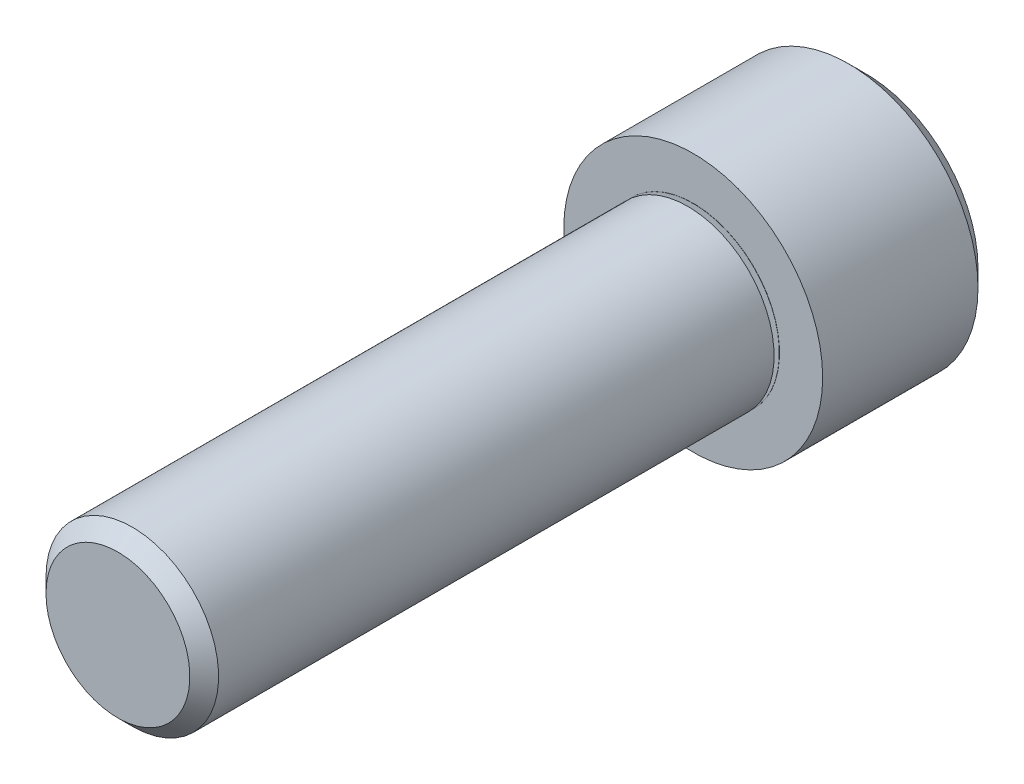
from build123d import *

# Parameters (mm, degrees)
CUT_EXTRUDE1_DEPTH = 4.7625


with BuildPart() as part:
    # Logo3_bib1 → Revolve1 (revolve)
    with BuildSketch(Plane(origin=(0, 0, 0), x_dir=(-1, 0, 0), z_dir=(0, -1, 0))):
        with BuildLine():
            Line((0, -31.75), (0, 9.525))
            Line((0, 9.525), (6.19125, 9.525))
            Line((6.19125, 9.525), (7.14375, 8.5725))
            Line((7.14375, 8.5725), (7.14375, 0))
            Line((7.14375, 0), (4.7625, 0))
            Line((4.7625, 0), (4.7625, -0.01))
            Line((4.7625, -0.01), (4.082175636, -0.01))
            ThreePointArc((4.082175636, -0.01), (4.062479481, -0.026527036), (4.075335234, -0.048793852))
            Line((4.075335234, -0.048793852), (4.7625, -0.298901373))
            Line((4.7625, -0.298901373), (4.7625, -30.95625))
            Line((4.7625, -30.95625), (3.96875, -31.75))
            Line((3.96875, -31.75), (0, -31.75))
        make_face()
    revolve(axis=Axis((0, 0, -10.585154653), (0, 0, 1)))

    # Logo3_bib2 → Cut-Extrude1 (cut)
    with BuildSketch(Plane(origin=(0, 0, -9.525), x_dir=(1, 0, 0), z_dir=(0, 0, -1))):
        Polygon((4.575385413, 0), (2.287692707, 3.9624), (-2.287692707, 3.9624), (-4.575385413, 0), (-2.287692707, -3.9624), (2.287692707, -3.9624), align=None)
    extrude(amount=-CUT_EXTRUDE1_DEPTH, mode=Mode.SUBTRACT)


solid = part.part
